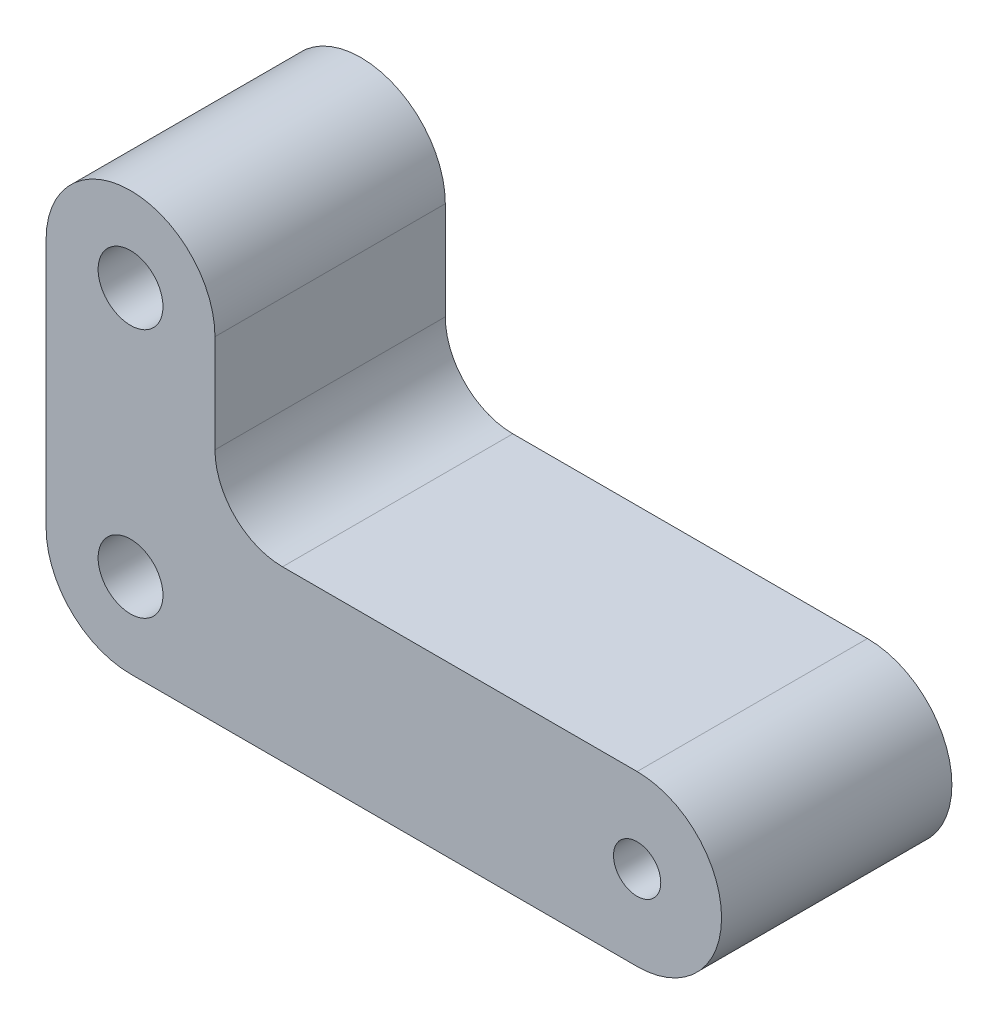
from build123d import *

# Parameters (mm, degrees)
BOSS_EXTRUDE1_DEPTH   = 8.6614
F_2_CLEARANCE_HOLE1_D = 2.4384
F_2_56_TAPPED_HOLE1_D = 1.778


with BuildPart() as part:
    # Sketch1 → Boss-Extrude1 (new body)
    with BuildSketch(Plane.XY):
        with BuildLine():
            Line((95.25, 31.877), (76.2, 31.877))
            ThreePointArc((76.2, 31.877), (73.95493597, 32.80693597), (73.025, 35.052))
            Line((73.025, 35.052), (73.025, 44.45))
            ThreePointArc((73.025, 44.45), (76.2, 47.625), (79.375, 44.45))
            Line((79.375, 44.45), (79.375, 40.767))
            ThreePointArc((79.375, 40.767), (80.118948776, 38.970948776), (81.915, 38.227))
            Line((81.915, 38.227), (95.25, 38.227))
            ThreePointArc((95.25, 38.227), (98.425, 35.052), (95.25, 31.877))
        make_face()
    extrude(amount=BOSS_EXTRUDE1_DEPTH)

    # 2 Clearance Hole1 (through all)
    with Locations(Plane.XY.offset(8.6614)):
        with Locations((76.2, 44.45), (76.2, 35.052)):
            Hole(F_2_CLEARANCE_HOLE1_D / 2)

    # 2-56 Tapped Hole1 (through all)
    with Locations(Plane.XY.offset(8.6614)):
        with Locations((95.25, 35.052)):
            Hole(F_2_56_TAPPED_HOLE1_D / 2)


solid = part.part
